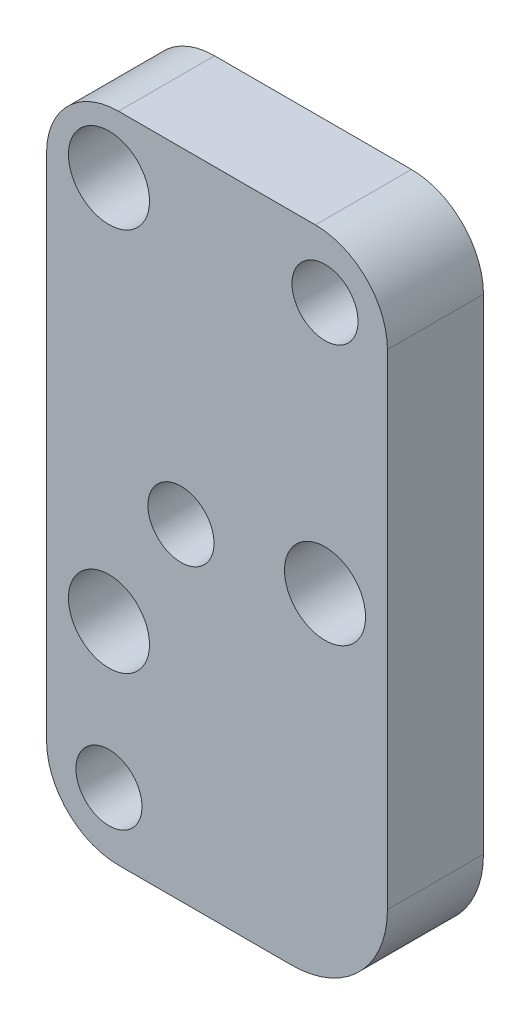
ISO-10303-21;
HEADER;
FILE_DESCRIPTION(('STEP AP214'),'2;1');
FILE_NAME('part.step','',(''),(''),'','','');
FILE_SCHEMA(('AUTOMOTIVE_DESIGN { 1 0 10303 214 1 1 1 1 }'));
ENDSEC;
DATA;
#1=APPLICATION_CONTEXT('core data for automotive mechanical design processes');
#2=APPLICATION_PROTOCOL_DEFINITION('international standard','automotive_design',2000,#1);
#3=PRODUCT_CONTEXT('',#1,'mechanical');
#4=PRODUCT('Part','Part','',(#3));
#5=PRODUCT_RELATED_PRODUCT_CATEGORY('part','',(#4));
#6=PRODUCT_DEFINITION_FORMATION('','',#4);
#7=PRODUCT_DEFINITION_CONTEXT('part definition',#1,'design');
#8=PRODUCT_DEFINITION('design','',#6,#7);
#9=PRODUCT_DEFINITION_SHAPE('','',#8);
#10=(LENGTH_UNIT() NAMED_UNIT(*) SI_UNIT(.MILLI.,.METRE.));
#11=(NAMED_UNIT(*) PLANE_ANGLE_UNIT() SI_UNIT($,.RADIAN.));
#12=(NAMED_UNIT(*) SI_UNIT($,.STERADIAN.) SOLID_ANGLE_UNIT());
#13=UNCERTAINTY_MEASURE_WITH_UNIT(LENGTH_MEASURE(1.E-05),#10,'distance_accuracy_value','');
#14=(GEOMETRIC_REPRESENTATION_CONTEXT(3) GLOBAL_UNCERTAINTY_ASSIGNED_CONTEXT((#13)) GLOBAL_UNIT_ASSIGNED_CONTEXT((#10,
#11,#12)) REPRESENTATION_CONTEXT('',''));
#15=CARTESIAN_POINT('',(0.,0.,0.));
#16=DIRECTION('',(0.,0.,1.));
#17=DIRECTION('',(1.,0.,0.));
#18=AXIS2_PLACEMENT_3D('',#15,#16,#17);
#19=CARTESIAN_POINT('',(-147.955,77.8002,84.6582));
#20=DIRECTION('',(0.,0.,-1.));
#21=DIRECTION('',(-1.,0.,0.));
#22=AXIS2_PLACEMENT_3D('',#19,#20,#21);
#23=CYLINDRICAL_SURFACE('',#22,9.52499999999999);
#24=CARTESIAN_POINT('',(-147.955,77.8002,71.9582));
#25=DIRECTION('',(0.,0.,-1.));
#26=DIRECTION('',(-1.,0.,0.));
#27=AXIS2_PLACEMENT_3D('',#24,#25,#26);
#28=CIRCLE('',#27,9.52499999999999);
#29=CARTESIAN_POINT('',(-157.48,77.8002,71.9582));
#30=VERTEX_POINT('',#29);
#31=CARTESIAN_POINT('',(-147.955,87.3252,71.9582));
#32=VERTEX_POINT('',#31);
#33=EDGE_CURVE('E149',#30,#32,#28,.T.);
#34=ORIENTED_EDGE('',*,*,#33,.F.);
#35=DIRECTION('',(0.,0.,-1.));
#36=VECTOR('',#35,1.);
#37=CARTESIAN_POINT('',(-157.48,77.8002,84.6582));
#38=LINE('',#37,#36);
#39=CARTESIAN_POINT('',(-157.48,77.8002,84.6582));
#40=VERTEX_POINT('',#39);
#41=EDGE_CURVE('E11',#40,#30,#38,.T.);
#42=ORIENTED_EDGE('',*,*,#41,.F.);
#43=CARTESIAN_POINT('',(-147.955,77.8002,84.6582));
#44=DIRECTION('',(0.,0.,-1.));
#45=DIRECTION('',(-1.,0.,0.));
#46=AXIS2_PLACEMENT_3D('',#43,#44,#45);
#47=CIRCLE('',#46,9.52499999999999);
#48=CARTESIAN_POINT('',(-147.955,87.3252,84.6582));
#49=VERTEX_POINT('',#48);
#50=EDGE_CURVE('E178',#40,#49,#47,.T.);
#51=ORIENTED_EDGE('',*,*,#50,.T.);
#52=DIRECTION('',(0.,0.,-1.));
#53=VECTOR('',#52,1.);
#54=CARTESIAN_POINT('',(-147.955,87.3252,84.6582));
#55=LINE('',#54,#53);
#56=EDGE_CURVE('E48',#49,#32,#55,.T.);
#57=ORIENTED_EDGE('',*,*,#56,.T.);
#58=EDGE_LOOP('',(#34,#42,#51,#57));
#59=FACE_BOUND('',#58,.T.);
#60=ADVANCED_FACE('F45',(#59),#23,.T.);
#61=CARTESIAN_POINT('',(-157.48,10.4902,84.6582));
#62=DIRECTION('',(-1.,0.,0.));
#63=DIRECTION('',(0.,-1.,0.));
#64=AXIS2_PLACEMENT_3D('',#61,#62,#63);
#65=PLANE('',#64);
#66=DIRECTION('',(0.,1.,0.));
#67=VECTOR('',#66,1.);
#68=CARTESIAN_POINT('',(-157.48,10.4902,71.9582));
#69=LINE('',#68,#67);
#70=CARTESIAN_POINT('',(-157.48,10.4902,71.9582));
#71=VERTEX_POINT('',#70);
#72=EDGE_CURVE('E175',#71,#30,#69,.T.);
#73=ORIENTED_EDGE('',*,*,#72,.F.);
#74=DIRECTION('',(0.,0.,-1.));
#75=VECTOR('',#74,1.);
#76=CARTESIAN_POINT('',(-157.48,10.4902,84.6582));
#77=LINE('',#76,#75);
#78=CARTESIAN_POINT('',(-157.48,10.4902,84.6582));
#79=VERTEX_POINT('',#78);
#80=EDGE_CURVE('E55',#79,#71,#77,.T.);
#81=ORIENTED_EDGE('',*,*,#80,.F.);
#82=DIRECTION('',(0.,1.,0.));
#83=VECTOR('',#82,1.);
#84=CARTESIAN_POINT('',(-157.48,10.4902,84.6582));
#85=LINE('',#84,#83);
#86=EDGE_CURVE('E134',#79,#40,#85,.T.);
#87=ORIENTED_EDGE('',*,*,#86,.T.);
#88=ORIENTED_EDGE('',*,*,#41,.T.);
#89=EDGE_LOOP('',(#73,#81,#87,#88));
#90=FACE_BOUND('',#89,.T.);
#91=ADVANCED_FACE('F198',(#90),#65,.T.);
#92=CARTESIAN_POINT('',(-147.955,10.4902,84.6582));
#93=DIRECTION('',(0.,0.,-1.));
#94=DIRECTION('',(-1.,0.,0.));
#95=AXIS2_PLACEMENT_3D('',#92,#93,#94);
#96=CYLINDRICAL_SURFACE('',#95,9.52500000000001);
#97=CARTESIAN_POINT('',(-147.955,10.4902,71.9582));
#98=DIRECTION('',(0.,0.,-1.));
#99=DIRECTION('',(-1.,0.,0.));
#100=AXIS2_PLACEMENT_3D('',#97,#98,#99);
#101=CIRCLE('',#100,9.52500000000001);
#102=CARTESIAN_POINT('',(-147.955,0.965200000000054,71.9582));
#103=VERTEX_POINT('',#102);
#104=EDGE_CURVE('E120',#103,#71,#101,.T.);
#105=ORIENTED_EDGE('',*,*,#104,.F.);
#106=DIRECTION('',(0.,0.,-1.));
#107=VECTOR('',#106,1.);
#108=CARTESIAN_POINT('',(-147.955,0.965200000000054,84.6582));
#109=LINE('',#108,#107);
#110=CARTESIAN_POINT('',(-147.955,0.965200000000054,84.6582));
#111=VERTEX_POINT('',#110);
#112=EDGE_CURVE('E115',#111,#103,#109,.T.);
#113=ORIENTED_EDGE('',*,*,#112,.F.);
#114=CARTESIAN_POINT('',(-147.955,10.4902,84.6582));
#115=DIRECTION('',(0.,0.,-1.));
#116=DIRECTION('',(-1.,0.,0.));
#117=AXIS2_PLACEMENT_3D('',#114,#115,#116);
#118=CIRCLE('',#117,9.52500000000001);
#119=EDGE_CURVE('E118',#111,#79,#118,.T.);
#120=ORIENTED_EDGE('',*,*,#119,.T.);
#121=ORIENTED_EDGE('',*,*,#80,.T.);
#122=EDGE_LOOP('',(#105,#113,#120,#121));
#123=FACE_BOUND('',#122,.T.);
#124=ADVANCED_FACE('F117',(#123),#96,.T.);
#125=CARTESIAN_POINT('',(-125.095,0.965200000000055,84.6582));
#126=DIRECTION('',(0.,-1.,0.));
#127=DIRECTION('',(1.,0.,0.));
#128=AXIS2_PLACEMENT_3D('',#125,#126,#127);
#129=PLANE('',#128);
#130=DIRECTION('',(-1.,0.,0.));
#131=VECTOR('',#130,1.);
#132=CARTESIAN_POINT('',(-125.095,0.965200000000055,71.9582));
#133=LINE('',#132,#131);
#134=CARTESIAN_POINT('',(-125.095,0.965200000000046,71.9582));
#135=VERTEX_POINT('',#134);
#136=EDGE_CURVE('E170',#135,#103,#133,.T.);
#137=ORIENTED_EDGE('',*,*,#136,.F.);
#138=DIRECTION('',(0.,0.,-1.));
#139=VECTOR('',#138,1.);
#140=CARTESIAN_POINT('',(-125.095,0.965200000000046,84.6582));
#141=LINE('',#140,#139);
#142=CARTESIAN_POINT('',(-125.095,0.965200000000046,84.6582));
#143=VERTEX_POINT('',#142);
#144=EDGE_CURVE('E126',#143,#135,#141,.T.);
#145=ORIENTED_EDGE('',*,*,#144,.F.);
#146=DIRECTION('',(-1.,0.,0.));
#147=VECTOR('',#146,1.);
#148=CARTESIAN_POINT('',(-125.095,0.965200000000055,84.6582));
#149=LINE('',#148,#147);
#150=EDGE_CURVE('E132',#143,#111,#149,.T.);
#151=ORIENTED_EDGE('',*,*,#150,.T.);
#152=ORIENTED_EDGE('',*,*,#112,.T.);
#153=EDGE_LOOP('',(#137,#145,#151,#152));
#154=FACE_BOUND('',#153,.T.);
#155=ADVANCED_FACE('F137',(#154),#129,.T.);
#156=CARTESIAN_POINT('',(-125.095,13.6652,84.6582));
#157=DIRECTION('',(0.,0.,-1.));
#158=DIRECTION('',(-1.,0.,0.));
#159=AXIS2_PLACEMENT_3D('',#156,#157,#158);
#160=CYLINDRICAL_SURFACE('',#159,12.7);
#161=CARTESIAN_POINT('',(-125.095,13.6652,71.9582));
#162=DIRECTION('',(0.,0.,-1.));
#163=DIRECTION('',(-1.,0.,0.));
#164=AXIS2_PLACEMENT_3D('',#161,#162,#163);
#165=CIRCLE('',#164,12.7);
#166=CARTESIAN_POINT('',(-112.395,13.6652,71.9582));
#167=VERTEX_POINT('',#166);
#168=EDGE_CURVE('E166',#167,#135,#165,.T.);
#169=ORIENTED_EDGE('',*,*,#168,.F.);
#170=DIRECTION('',(0.,0.,-1.));
#171=VECTOR('',#170,1.);
#172=CARTESIAN_POINT('',(-112.395,13.6652,84.6582));
#173=LINE('',#172,#171);
#174=CARTESIAN_POINT('',(-112.395,13.6652,84.6582));
#175=VERTEX_POINT('',#174);
#176=EDGE_CURVE('E184',#175,#167,#173,.T.);
#177=ORIENTED_EDGE('',*,*,#176,.F.);
#178=CARTESIAN_POINT('',(-125.095,13.6652,84.6582));
#179=DIRECTION('',(0.,0.,-1.));
#180=DIRECTION('',(-1.,0.,0.));
#181=AXIS2_PLACEMENT_3D('',#178,#179,#180);
#182=CIRCLE('',#181,12.7);
#183=EDGE_CURVE('E139',#175,#143,#182,.T.);
#184=ORIENTED_EDGE('',*,*,#183,.T.);
#185=ORIENTED_EDGE('',*,*,#144,.T.);
#186=EDGE_LOOP('',(#169,#177,#184,#185));
#187=FACE_BOUND('',#186,.T.);
#188=ADVANCED_FACE('F211',(#187),#160,.T.);
#189=CARTESIAN_POINT('',(-112.395,77.8002,84.6582));
#190=DIRECTION('',(1.,0.,0.));
#191=DIRECTION('',(0.,1.,0.));
#192=AXIS2_PLACEMENT_3D('',#189,#190,#191);
#193=PLANE('',#192);
#194=DIRECTION('',(0.,-1.,0.));
#195=VECTOR('',#194,1.);
#196=CARTESIAN_POINT('',(-112.395,77.8002,71.9582));
#197=LINE('',#196,#195);
#198=CARTESIAN_POINT('',(-112.395,77.8002,71.9582));
#199=VERTEX_POINT('',#198);
#200=EDGE_CURVE('E162',#199,#167,#197,.T.);
#201=ORIENTED_EDGE('',*,*,#200,.F.);
#202=DIRECTION('',(0.,0.,-1.));
#203=VECTOR('',#202,1.);
#204=CARTESIAN_POINT('',(-112.395,77.8002,84.6582));
#205=LINE('',#204,#203);
#206=CARTESIAN_POINT('',(-112.395,77.8002,84.6582));
#207=VERTEX_POINT('',#206);
#208=EDGE_CURVE('E187',#207,#199,#205,.T.);
#209=ORIENTED_EDGE('',*,*,#208,.F.);
#210=DIRECTION('',(0.,-1.,0.));
#211=VECTOR('',#210,1.);
#212=CARTESIAN_POINT('',(-112.395,77.8002,84.6582));
#213=LINE('',#212,#211);
#214=EDGE_CURVE('E143',#207,#175,#213,.T.);
#215=ORIENTED_EDGE('',*,*,#214,.T.);
#216=ORIENTED_EDGE('',*,*,#176,.T.);
#217=EDGE_LOOP('',(#201,#209,#215,#216));
#218=FACE_BOUND('',#217,.T.);
#219=ADVANCED_FACE('F214',(#218),#193,.T.);
#220=CARTESIAN_POINT('',(-121.92,77.8002,84.6582));
#221=DIRECTION('',(0.,0.,-1.));
#222=DIRECTION('',(-1.,0.,0.));
#223=AXIS2_PLACEMENT_3D('',#220,#221,#222);
#224=CYLINDRICAL_SURFACE('',#223,9.525);
#225=CARTESIAN_POINT('',(-121.92,77.8002,71.9582));
#226=DIRECTION('',(0.,0.,-1.));
#227=DIRECTION('',(-1.,0.,0.));
#228=AXIS2_PLACEMENT_3D('',#225,#226,#227);
#229=CIRCLE('',#228,9.525);
#230=CARTESIAN_POINT('',(-121.92,87.3252,71.9582));
#231=VERTEX_POINT('',#230);
#232=EDGE_CURVE('E158',#231,#199,#229,.T.);
#233=ORIENTED_EDGE('',*,*,#232,.F.);
#234=DIRECTION('',(0.,0.,-1.));
#235=VECTOR('',#234,1.);
#236=CARTESIAN_POINT('',(-121.92,87.3252,84.6582));
#237=LINE('',#236,#235);
#238=CARTESIAN_POINT('',(-121.92,87.3252,84.6582));
#239=VERTEX_POINT('',#238);
#240=EDGE_CURVE('E189',#239,#231,#237,.T.);
#241=ORIENTED_EDGE('',*,*,#240,.F.);
#242=CARTESIAN_POINT('',(-121.92,77.8002,84.6582));
#243=DIRECTION('',(0.,0.,-1.));
#244=DIRECTION('',(-1.,0.,0.));
#245=AXIS2_PLACEMENT_3D('',#242,#243,#244);
#246=CIRCLE('',#245,9.525);
#247=EDGE_CURVE('E365',#239,#207,#246,.T.);
#248=ORIENTED_EDGE('',*,*,#247,.T.);
#249=ORIENTED_EDGE('',*,*,#208,.T.);
#250=EDGE_LOOP('',(#233,#241,#248,#249));
#251=FACE_BOUND('',#250,.T.);
#252=ADVANCED_FACE('F218',(#251),#224,.T.);
#253=CARTESIAN_POINT('',(-147.955,87.3252,84.6582));
#254=DIRECTION('',(0.,1.,0.));
#255=DIRECTION('',(-1.,0.,0.));
#256=AXIS2_PLACEMENT_3D('',#253,#254,#255);
#257=PLANE('',#256);
#258=DIRECTION('',(1.,0.,0.));
#259=VECTOR('',#258,1.);
#260=CARTESIAN_POINT('',(-147.955,87.3252,71.9582));
#261=LINE('',#260,#259);
#262=EDGE_CURVE('E153',#32,#231,#261,.T.);
#263=ORIENTED_EDGE('',*,*,#262,.F.);
#264=ORIENTED_EDGE('',*,*,#56,.F.);
#265=DIRECTION('',(1.,0.,0.));
#266=VECTOR('',#265,1.);
#267=CARTESIAN_POINT('',(-147.955,87.3252,84.6582));
#268=LINE('',#267,#266);
#269=EDGE_CURVE('E362',#49,#239,#268,.T.);
#270=ORIENTED_EDGE('',*,*,#269,.T.);
#271=ORIENTED_EDGE('',*,*,#240,.T.);
#272=EDGE_LOOP('',(#263,#264,#270,#271));
#273=FACE_BOUND('',#272,.T.);
#274=ADVANCED_FACE('F195',(#273),#257,.T.);
#275=CARTESIAN_POINT('',(-147.955,77.8002,84.6582));
#276=DIRECTION('',(0.,0.,-1.));
#277=DIRECTION('',(-1.,0.,0.));
#278=AXIS2_PLACEMENT_3D('',#275,#276,#277);
#279=PLANE('',#278);
#280=CARTESIAN_POINT('',(-120.65,79.0702,84.6582));
#281=DIRECTION('',(0.,0.,-1.));
#282=DIRECTION('',(-1.,0.,0.));
#283=AXIS2_PLACEMENT_3D('',#280,#281,#282);
#284=CIRCLE('',#283,4.36879999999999);
#285=CARTESIAN_POINT('',(-125.0188,79.0702,84.6582));
#286=VERTEX_POINT('',#285);
#287=EDGE_CURVE('E287',#286,#286,#284,.T.);
#288=ORIENTED_EDGE('',*,*,#287,.T.);
#289=EDGE_LOOP('',(#288));
#290=FACE_BOUND('',#289,.T.);
#291=CARTESIAN_POINT('',(-139.7,44.1452000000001,84.6582));
#292=DIRECTION('',(0.,0.,-1.));
#293=DIRECTION('',(-1.,0.,0.));
#294=AXIS2_PLACEMENT_3D('',#291,#292,#293);
#295=CIRCLE('',#294,4.36880000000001);
#296=CARTESIAN_POINT('',(-144.0688,44.1452000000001,84.6582));
#297=VERTEX_POINT('',#296);
#298=EDGE_CURVE('E292',#297,#297,#295,.T.);
#299=ORIENTED_EDGE('',*,*,#298,.T.);
#300=EDGE_LOOP('',(#299));
#301=FACE_BOUND('',#300,.T.);
#302=CARTESIAN_POINT('',(-149.225,9.22020000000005,84.6582));
#303=DIRECTION('',(0.,0.,-1.));
#304=DIRECTION('',(-1.,0.,0.));
#305=AXIS2_PLACEMENT_3D('',#302,#303,#304);
#306=CIRCLE('',#305,4.36880000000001);
#307=CARTESIAN_POINT('',(-153.5938,9.22020000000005,84.6582));
#308=VERTEX_POINT('',#307);
#309=EDGE_CURVE('E305',#308,#308,#306,.T.);
#310=ORIENTED_EDGE('',*,*,#309,.T.);
#311=EDGE_LOOP('',(#310));
#312=FACE_BOUND('',#311,.T.);
#313=CARTESIAN_POINT('',(-149.225,28.2702,84.6582));
#314=DIRECTION('',(0.,0.,1.));
#315=DIRECTION('',(1.,0.,0.));
#316=AXIS2_PLACEMENT_3D('',#313,#314,#315);
#317=CIRCLE('',#316,5.35939999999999);
#318=CARTESIAN_POINT('',(-143.8656,28.2702,84.6582));
#319=VERTEX_POINT('',#318);
#320=EDGE_CURVE('E325',#319,#319,#317,.T.);
#321=ORIENTED_EDGE('',*,*,#320,.F.);
#322=EDGE_LOOP('',(#321));
#323=FACE_BOUND('',#322,.T.);
#324=CARTESIAN_POINT('',(-120.65,45.7327,84.6582));
#325=DIRECTION('',(0.,0.,1.));
#326=DIRECTION('',(1.,0.,0.));
#327=AXIS2_PLACEMENT_3D('',#324,#325,#326);
#328=CIRCLE('',#327,5.3594);
#329=CARTESIAN_POINT('',(-115.2906,45.7327,84.6582));
#330=VERTEX_POINT('',#329);
#331=EDGE_CURVE('E341',#330,#330,#328,.T.);
#332=ORIENTED_EDGE('',*,*,#331,.F.);
#333=EDGE_LOOP('',(#332));
#334=FACE_BOUND('',#333,.T.);
#335=CARTESIAN_POINT('',(-149.225,79.0702,84.6582));
#336=DIRECTION('',(0.,0.,1.));
#337=DIRECTION('',(1.,0.,0.));
#338=AXIS2_PLACEMENT_3D('',#335,#336,#337);
#339=CIRCLE('',#338,5.35939999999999);
#340=CARTESIAN_POINT('',(-143.8656,79.0702,84.6582));
#341=VERTEX_POINT('',#340);
#342=EDGE_CURVE('E154',#341,#341,#339,.T.);
#343=ORIENTED_EDGE('',*,*,#342,.F.);
#344=EDGE_LOOP('',(#343));
#345=FACE_BOUND('',#344,.T.);
#346=ORIENTED_EDGE('',*,*,#50,.F.);
#347=ORIENTED_EDGE('',*,*,#86,.F.);
#348=ORIENTED_EDGE('',*,*,#119,.F.);
#349=ORIENTED_EDGE('',*,*,#150,.F.);
#350=ORIENTED_EDGE('',*,*,#183,.F.);
#351=ORIENTED_EDGE('',*,*,#214,.F.);
#352=ORIENTED_EDGE('',*,*,#247,.F.);
#353=ORIENTED_EDGE('',*,*,#269,.F.);
#354=EDGE_LOOP('',(#346,#347,#348,#349,#350,#351,#352,#353));
#355=FACE_BOUND('',#354,.T.);
#356=ADVANCED_FACE('F130',(#290,#301,#312,#323,#334,#345,#355),#279,.F.);
#357=CARTESIAN_POINT('',(-147.955,77.8002,71.9582));
#358=DIRECTION('',(0.,0.,-1.));
#359=DIRECTION('',(-1.,0.,0.));
#360=AXIS2_PLACEMENT_3D('',#357,#358,#359);
#361=PLANE('',#360);
#362=CARTESIAN_POINT('',(-120.65,79.0702,71.9582));
#363=DIRECTION('',(0.,0.,-1.));
#364=DIRECTION('',(-1.,0.,0.));
#365=AXIS2_PLACEMENT_3D('',#362,#363,#364);
#366=CIRCLE('',#365,4.36880000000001);
#367=CARTESIAN_POINT('',(-125.0188,79.0702,71.9582));
#368=VERTEX_POINT('',#367);
#369=EDGE_CURVE('E290',#368,#368,#366,.T.);
#370=ORIENTED_EDGE('',*,*,#369,.F.);
#371=EDGE_LOOP('',(#370));
#372=FACE_BOUND('',#371,.T.);
#373=CARTESIAN_POINT('',(-139.7,44.1452000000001,71.9582));
#374=DIRECTION('',(0.,0.,-1.));
#375=DIRECTION('',(-1.,0.,0.));
#376=AXIS2_PLACEMENT_3D('',#373,#374,#375);
#377=CIRCLE('',#376,4.36880000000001);
#378=CARTESIAN_POINT('',(-144.0688,44.1452000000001,71.9582));
#379=VERTEX_POINT('',#378);
#380=EDGE_CURVE('E298',#379,#379,#377,.T.);
#381=ORIENTED_EDGE('',*,*,#380,.F.);
#382=EDGE_LOOP('',(#381));
#383=FACE_BOUND('',#382,.T.);
#384=CARTESIAN_POINT('',(-149.225,9.22020000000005,71.9582));
#385=DIRECTION('',(0.,0.,-1.));
#386=DIRECTION('',(-1.,0.,0.));
#387=AXIS2_PLACEMENT_3D('',#384,#385,#386);
#388=CIRCLE('',#387,4.36880000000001);
#389=CARTESIAN_POINT('',(-153.5938,9.22020000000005,71.9582));
#390=VERTEX_POINT('',#389);
#391=EDGE_CURVE('E309',#390,#390,#388,.T.);
#392=ORIENTED_EDGE('',*,*,#391,.F.);
#393=EDGE_LOOP('',(#392));
#394=FACE_BOUND('',#393,.T.);
#395=CARTESIAN_POINT('',(-149.225,28.2702,71.9582));
#396=DIRECTION('',(0.,0.,1.));
#397=DIRECTION('',(1.,0.,0.));
#398=AXIS2_PLACEMENT_3D('',#395,#396,#397);
#399=CIRCLE('',#398,3.56870000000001);
#400=CARTESIAN_POINT('',(-145.6563,28.2702,71.9582));
#401=VERTEX_POINT('',#400);
#402=EDGE_CURVE('E313',#401,#401,#399,.T.);
#403=ORIENTED_EDGE('',*,*,#402,.T.);
#404=EDGE_LOOP('',(#403));
#405=FACE_BOUND('',#404,.T.);
#406=CARTESIAN_POINT('',(-120.65,45.7327,71.9582));
#407=DIRECTION('',(0.,0.,1.));
#408=DIRECTION('',(1.,0.,0.));
#409=AXIS2_PLACEMENT_3D('',#406,#407,#408);
#410=CIRCLE('',#409,3.56869999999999);
#411=CARTESIAN_POINT('',(-117.0813,45.7327,71.9582));
#412=VERTEX_POINT('',#411);
#413=EDGE_CURVE('E329',#412,#412,#410,.T.);
#414=ORIENTED_EDGE('',*,*,#413,.T.);
#415=EDGE_LOOP('',(#414));
#416=FACE_BOUND('',#415,.T.);
#417=CARTESIAN_POINT('',(-149.225,79.0702,71.9582));
#418=DIRECTION('',(0.,0.,1.));
#419=DIRECTION('',(1.,0.,0.));
#420=AXIS2_PLACEMENT_3D('',#417,#418,#419);
#421=CIRCLE('',#420,3.56870000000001);
#422=CARTESIAN_POINT('',(-145.6563,79.0702,71.9582));
#423=VERTEX_POINT('',#422);
#424=EDGE_CURVE('E345',#423,#423,#421,.T.);
#425=ORIENTED_EDGE('',*,*,#424,.T.);
#426=EDGE_LOOP('',(#425));
#427=FACE_BOUND('',#426,.T.);
#428=ORIENTED_EDGE('',*,*,#33,.T.);
#429=ORIENTED_EDGE('',*,*,#262,.T.);
#430=ORIENTED_EDGE('',*,*,#232,.T.);
#431=ORIENTED_EDGE('',*,*,#200,.T.);
#432=ORIENTED_EDGE('',*,*,#168,.T.);
#433=ORIENTED_EDGE('',*,*,#136,.T.);
#434=ORIENTED_EDGE('',*,*,#104,.T.);
#435=ORIENTED_EDGE('',*,*,#72,.T.);
#436=EDGE_LOOP('',(#428,#429,#430,#431,#432,#433,#434,#435));
#437=FACE_BOUND('',#436,.T.);
#438=ADVANCED_FACE('F197',(#372,#383,#394,#405,#416,#427,#437),#361,.T.);
#439=CARTESIAN_POINT('',(-149.225,79.0702,84.6582));
#440=DIRECTION('',(0.,0.,1.));
#441=DIRECTION('',(1.,0.,0.));
#442=AXIS2_PLACEMENT_3D('',#439,#440,#441);
#443=CYLINDRICAL_SURFACE('',#442,5.35939999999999);
#444=CARTESIAN_POINT('',(-149.225,79.0702,76.7842));
#445=DIRECTION('',(0.,0.,1.));
#446=DIRECTION('',(1.,0.,0.));
#447=AXIS2_PLACEMENT_3D('',#444,#445,#446);
#448=CIRCLE('',#447,5.35939999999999);
#449=CARTESIAN_POINT('',(-143.8656,79.0702,76.7842));
#450=VERTEX_POINT('',#449);
#451=EDGE_CURVE('E353',#450,#450,#448,.T.);
#452=ORIENTED_EDGE('',*,*,#451,.F.);
#453=EDGE_LOOP('',(#452));
#454=FACE_BOUND('',#453,.T.);
#455=ORIENTED_EDGE('',*,*,#342,.T.);
#456=EDGE_LOOP('',(#455));
#457=FACE_BOUND('',#456,.T.);
#458=ADVANCED_FACE('F232',(#454,#457),#443,.F.);
#459=CARTESIAN_POINT('',(-145.6563,79.0702,76.7842));
#460=DIRECTION('',(0.,0.,-1.));
#461=DIRECTION('',(-1.,0.,0.));
#462=AXIS2_PLACEMENT_3D('',#459,#460,#461);
#463=PLANE('',#462);
#464=CARTESIAN_POINT('',(-149.225,79.0702,76.7842));
#465=DIRECTION('',(0.,0.,1.));
#466=DIRECTION('',(1.,0.,0.));
#467=AXIS2_PLACEMENT_3D('',#464,#465,#466);
#468=CIRCLE('',#467,3.56870000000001);
#469=CARTESIAN_POINT('',(-145.6563,79.0702,76.7842));
#470=VERTEX_POINT('',#469);
#471=EDGE_CURVE('E349',#470,#470,#468,.T.);
#472=ORIENTED_EDGE('',*,*,#471,.F.);
#473=EDGE_LOOP('',(#472));
#474=FACE_BOUND('',#473,.T.);
#475=ORIENTED_EDGE('',*,*,#451,.T.);
#476=EDGE_LOOP('',(#475));
#477=FACE_BOUND('',#476,.T.);
#478=ADVANCED_FACE('F239',(#474,#477),#463,.F.);
#479=CARTESIAN_POINT('',(-149.225,79.0702,84.6582));
#480=DIRECTION('',(0.,0.,1.));
#481=DIRECTION('',(1.,0.,0.));
#482=AXIS2_PLACEMENT_3D('',#479,#480,#481);
#483=CYLINDRICAL_SURFACE('',#482,3.56870000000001);
#484=ORIENTED_EDGE('',*,*,#424,.F.);
#485=EDGE_LOOP('',(#484));
#486=FACE_BOUND('',#485,.T.);
#487=ORIENTED_EDGE('',*,*,#471,.T.);
#488=EDGE_LOOP('',(#487));
#489=FACE_BOUND('',#488,.T.);
#490=ADVANCED_FACE('F243',(#486,#489),#483,.F.);
#491=CARTESIAN_POINT('',(-120.65,45.7327,84.6582));
#492=DIRECTION('',(0.,0.,1.));
#493=DIRECTION('',(1.,0.,0.));
#494=AXIS2_PLACEMENT_3D('',#491,#492,#493);
#495=CYLINDRICAL_SURFACE('',#494,5.3594);
#496=CARTESIAN_POINT('',(-120.65,45.7327,76.7842));
#497=DIRECTION('',(0.,0.,1.));
#498=DIRECTION('',(1.,0.,0.));
#499=AXIS2_PLACEMENT_3D('',#496,#497,#498);
#500=CIRCLE('',#499,5.3594);
#501=CARTESIAN_POINT('',(-115.2906,45.7327,76.7842));
#502=VERTEX_POINT('',#501);
#503=EDGE_CURVE('E337',#502,#502,#500,.T.);
#504=ORIENTED_EDGE('',*,*,#503,.F.);
#505=EDGE_LOOP('',(#504));
#506=FACE_BOUND('',#505,.T.);
#507=ORIENTED_EDGE('',*,*,#331,.T.);
#508=EDGE_LOOP('',(#507));
#509=FACE_BOUND('',#508,.T.);
#510=ADVANCED_FACE('F247',(#506,#509),#495,.F.);
#511=CARTESIAN_POINT('',(-117.0813,45.7327,76.7842));
#512=DIRECTION('',(0.,0.,-1.));
#513=DIRECTION('',(-1.,0.,0.));
#514=AXIS2_PLACEMENT_3D('',#511,#512,#513);
#515=PLANE('',#514);
#516=CARTESIAN_POINT('',(-120.65,45.7327,76.7842));
#517=DIRECTION('',(0.,0.,1.));
#518=DIRECTION('',(1.,0.,0.));
#519=AXIS2_PLACEMENT_3D('',#516,#517,#518);
#520=CIRCLE('',#519,3.56869999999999);
#521=CARTESIAN_POINT('',(-117.0813,45.7327,76.7842));
#522=VERTEX_POINT('',#521);
#523=EDGE_CURVE('E333',#522,#522,#520,.T.);
#524=ORIENTED_EDGE('',*,*,#523,.F.);
#525=EDGE_LOOP('',(#524));
#526=FACE_BOUND('',#525,.T.);
#527=ORIENTED_EDGE('',*,*,#503,.T.);
#528=EDGE_LOOP('',(#527));
#529=FACE_BOUND('',#528,.T.);
#530=ADVANCED_FACE('F251',(#526,#529),#515,.F.);
#531=CARTESIAN_POINT('',(-120.65,45.7327,84.6582));
#532=DIRECTION('',(0.,0.,1.));
#533=DIRECTION('',(1.,0.,0.));
#534=AXIS2_PLACEMENT_3D('',#531,#532,#533);
#535=CYLINDRICAL_SURFACE('',#534,3.56869999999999);
#536=ORIENTED_EDGE('',*,*,#413,.F.);
#537=EDGE_LOOP('',(#536));
#538=FACE_BOUND('',#537,.T.);
#539=ORIENTED_EDGE('',*,*,#523,.T.);
#540=EDGE_LOOP('',(#539));
#541=FACE_BOUND('',#540,.T.);
#542=ADVANCED_FACE('F255',(#538,#541),#535,.F.);
#543=CARTESIAN_POINT('',(-149.225,28.2702,84.6582));
#544=DIRECTION('',(0.,0.,1.));
#545=DIRECTION('',(1.,0.,0.));
#546=AXIS2_PLACEMENT_3D('',#543,#544,#545);
#547=CYLINDRICAL_SURFACE('',#546,5.35939999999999);
#548=CARTESIAN_POINT('',(-149.225,28.2702,76.7842));
#549=DIRECTION('',(0.,0.,1.));
#550=DIRECTION('',(1.,0.,0.));
#551=AXIS2_PLACEMENT_3D('',#548,#549,#550);
#552=CIRCLE('',#551,5.35939999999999);
#553=CARTESIAN_POINT('',(-143.8656,28.2702,76.7842));
#554=VERTEX_POINT('',#553);
#555=EDGE_CURVE('E321',#554,#554,#552,.T.);
#556=ORIENTED_EDGE('',*,*,#555,.F.);
#557=EDGE_LOOP('',(#556));
#558=FACE_BOUND('',#557,.T.);
#559=ORIENTED_EDGE('',*,*,#320,.T.);
#560=EDGE_LOOP('',(#559));
#561=FACE_BOUND('',#560,.T.);
#562=ADVANCED_FACE('F259',(#558,#561),#547,.F.);
#563=CARTESIAN_POINT('',(-145.6563,28.2702,76.7842));
#564=DIRECTION('',(0.,0.,-1.));
#565=DIRECTION('',(-1.,0.,0.));
#566=AXIS2_PLACEMENT_3D('',#563,#564,#565);
#567=PLANE('',#566);
#568=CARTESIAN_POINT('',(-149.225,28.2702,76.7842));
#569=DIRECTION('',(0.,0.,1.));
#570=DIRECTION('',(1.,0.,0.));
#571=AXIS2_PLACEMENT_3D('',#568,#569,#570);
#572=CIRCLE('',#571,3.56870000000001);
#573=CARTESIAN_POINT('',(-145.6563,28.2702,76.7842));
#574=VERTEX_POINT('',#573);
#575=EDGE_CURVE('E317',#574,#574,#572,.T.);
#576=ORIENTED_EDGE('',*,*,#575,.F.);
#577=EDGE_LOOP('',(#576));
#578=FACE_BOUND('',#577,.T.);
#579=ORIENTED_EDGE('',*,*,#555,.T.);
#580=EDGE_LOOP('',(#579));
#581=FACE_BOUND('',#580,.T.);
#582=ADVANCED_FACE('F263',(#578,#581),#567,.F.);
#583=CARTESIAN_POINT('',(-149.225,28.2702,84.6582));
#584=DIRECTION('',(0.,0.,1.));
#585=DIRECTION('',(1.,0.,0.));
#586=AXIS2_PLACEMENT_3D('',#583,#584,#585);
#587=CYLINDRICAL_SURFACE('',#586,3.56870000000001);
#588=ORIENTED_EDGE('',*,*,#402,.F.);
#589=EDGE_LOOP('',(#588));
#590=FACE_BOUND('',#589,.T.);
#591=ORIENTED_EDGE('',*,*,#575,.T.);
#592=EDGE_LOOP('',(#591));
#593=FACE_BOUND('',#592,.T.);
#594=ADVANCED_FACE('F267',(#590,#593),#587,.F.);
#595=CARTESIAN_POINT('',(-149.225,9.22020000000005,71.9582));
#596=DIRECTION('',(0.,0.,-1.));
#597=DIRECTION('',(-1.,0.,0.));
#598=AXIS2_PLACEMENT_3D('',#595,#596,#597);
#599=CYLINDRICAL_SURFACE('',#598,4.36880000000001);
#600=ORIENTED_EDGE('',*,*,#309,.F.);
#601=EDGE_LOOP('',(#600));
#602=FACE_BOUND('',#601,.T.);
#603=ORIENTED_EDGE('',*,*,#391,.T.);
#604=EDGE_LOOP('',(#603));
#605=FACE_BOUND('',#604,.T.);
#606=ADVANCED_FACE('F271',(#602,#605),#599,.F.);
#607=CARTESIAN_POINT('',(-139.7,44.1452000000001,71.9582));
#608=DIRECTION('',(0.,0.,-1.));
#609=DIRECTION('',(-1.,0.,0.));
#610=AXIS2_PLACEMENT_3D('',#607,#608,#609);
#611=CYLINDRICAL_SURFACE('',#610,4.36880000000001);
#612=ORIENTED_EDGE('',*,*,#298,.F.);
#613=EDGE_LOOP('',(#612));
#614=FACE_BOUND('',#613,.T.);
#615=ORIENTED_EDGE('',*,*,#380,.T.);
#616=EDGE_LOOP('',(#615));
#617=FACE_BOUND('',#616,.T.);
#618=ADVANCED_FACE('F275',(#614,#617),#611,.F.);
#619=CARTESIAN_POINT('',(-120.65,79.0702,71.9582));
#620=DIRECTION('',(0.,0.,-1.));
#621=DIRECTION('',(-1.,0.,0.));
#622=AXIS2_PLACEMENT_3D('',#619,#620,#621);
#623=CYLINDRICAL_SURFACE('',#622,4.3688);
#624=ORIENTED_EDGE('',*,*,#287,.F.);
#625=EDGE_LOOP('',(#624));
#626=FACE_BOUND('',#625,.T.);
#627=ORIENTED_EDGE('',*,*,#369,.T.);
#628=EDGE_LOOP('',(#627));
#629=FACE_BOUND('',#628,.T.);
#630=ADVANCED_FACE('F279',(#626,#629),#623,.F.);
#631=CLOSED_SHELL('',(#60,#91,#124,#155,#188,#219,#252,#274,#356,#438,#458,#478,#490,#510,#530,
#542,#562,#582,#594,#606,#618,#630));
#632=MANIFOLD_SOLID_BREP('B2',#631);
#633=ADVANCED_BREP_SHAPE_REPRESENTATION('',(#18,#632),#14);
#634=SHAPE_DEFINITION_REPRESENTATION(#9,#633);
ENDSEC;
END-ISO-10303-21;
